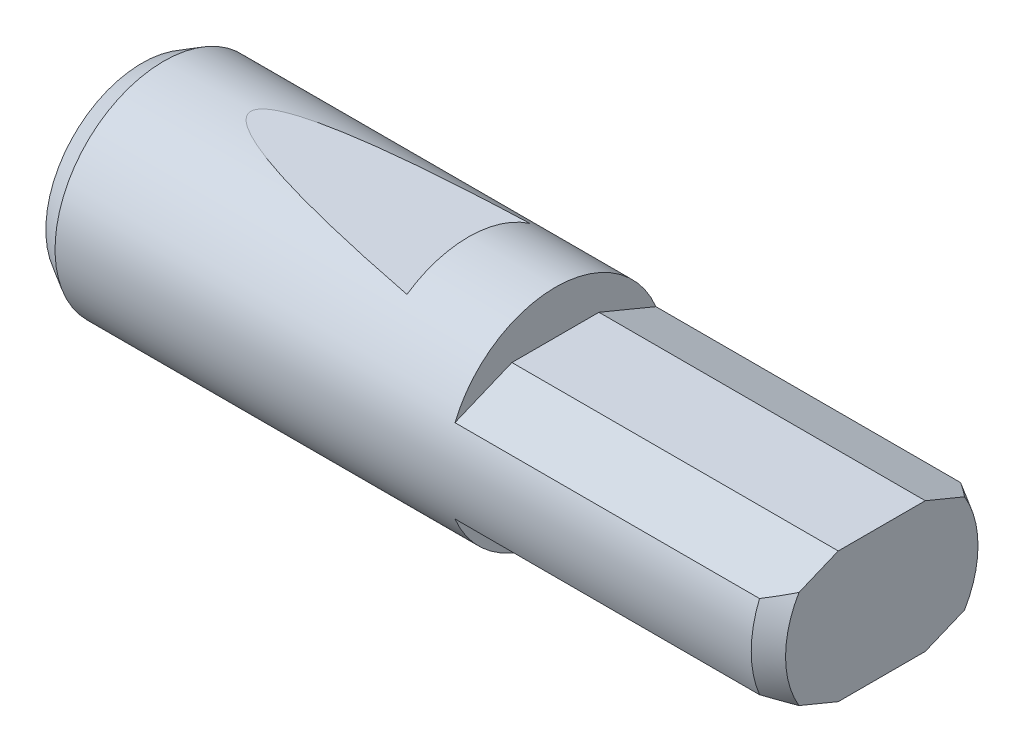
ISO-10303-21;
HEADER;
FILE_DESCRIPTION(('STEP AP214'),'2;1');
FILE_NAME('part.step','',(''),(''),'','','');
FILE_SCHEMA(('AUTOMOTIVE_DESIGN { 1 0 10303 214 1 1 1 1 }'));
ENDSEC;
DATA;
#1=APPLICATION_CONTEXT('core data for automotive mechanical design processes');
#2=APPLICATION_PROTOCOL_DEFINITION('international standard','automotive_design',2000,#1);
#3=PRODUCT_CONTEXT('',#1,'mechanical');
#4=PRODUCT('Part','Part','',(#3));
#5=PRODUCT_RELATED_PRODUCT_CATEGORY('part','',(#4));
#6=PRODUCT_DEFINITION_FORMATION('','',#4);
#7=PRODUCT_DEFINITION_CONTEXT('part definition',#1,'design');
#8=PRODUCT_DEFINITION('design','',#6,#7);
#9=PRODUCT_DEFINITION_SHAPE('','',#8);
#10=(LENGTH_UNIT() NAMED_UNIT(*) SI_UNIT(.MILLI.,.METRE.));
#11=(NAMED_UNIT(*) PLANE_ANGLE_UNIT() SI_UNIT($,.RADIAN.));
#12=(NAMED_UNIT(*) SI_UNIT($,.STERADIAN.) SOLID_ANGLE_UNIT());
#13=UNCERTAINTY_MEASURE_WITH_UNIT(LENGTH_MEASURE(1.E-05),#10,'distance_accuracy_value','');
#14=(GEOMETRIC_REPRESENTATION_CONTEXT(3) GLOBAL_UNCERTAINTY_ASSIGNED_CONTEXT((#13)) GLOBAL_UNIT_ASSIGNED_CONTEXT((#10,
#11,#12)) REPRESENTATION_CONTEXT('',''));
#15=CARTESIAN_POINT('',(0.,0.,0.));
#16=DIRECTION('',(0.,0.,1.));
#17=DIRECTION('',(1.,0.,0.));
#18=AXIS2_PLACEMENT_3D('',#15,#16,#17);
#19=CARTESIAN_POINT('',(-15.1011722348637,0.,0.));
#20=DIRECTION('',(-1.,0.,0.));
#21=DIRECTION('',(0.,0.,1.));
#22=AXIS2_PLACEMENT_3D('',#19,#20,#21);
#23=CYLINDRICAL_SURFACE('',#22,5.);
#24=DIRECTION('',(1.,0.,0.));
#25=VECTOR('',#24,1.);
#26=CARTESIAN_POINT('',(19.,-1.91534007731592,-4.61860069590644));
#27=LINE('',#26,#25);
#28=CARTESIAN_POINT('',(19.,-1.91534007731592,-4.61860069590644));
#29=VERTEX_POINT('',#28);
#30=CARTESIAN_POINT('',(33.,-1.91534007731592,-4.61860069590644));
#31=VERTEX_POINT('',#30);
#32=EDGE_CURVE('E589',#29,#31,#27,.T.);
#33=ORIENTED_EDGE('',*,*,#32,.F.);
#34=CARTESIAN_POINT('',(19.,0.,0.));
#35=DIRECTION('',(1.,0.,0.));
#36=DIRECTION('',(0.,0.,-1.));
#37=AXIS2_PLACEMENT_3D('',#34,#35,#36);
#38=CIRCLE('',#37,5.);
#39=CARTESIAN_POINT('',(19.,-1.91534007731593,4.61860069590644));
#40=VERTEX_POINT('',#39);
#41=EDGE_CURVE('E455',#40,#29,#38,.T.);
#42=ORIENTED_EDGE('',*,*,#41,.F.);
#43=DIRECTION('',(1.,0.,0.));
#44=VECTOR('',#43,1.);
#45=CARTESIAN_POINT('',(19.,-1.91534007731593,4.61860069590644));
#46=LINE('',#45,#44);
#47=CARTESIAN_POINT('',(33.,-1.91534007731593,4.61860069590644));
#48=VERTEX_POINT('',#47);
#49=EDGE_CURVE('E540',#40,#48,#46,.T.);
#50=ORIENTED_EDGE('',*,*,#49,.T.);
#51=CARTESIAN_POINT('',(33.,0.,0.));
#52=DIRECTION('',(-1.,0.,0.));
#53=DIRECTION('',(0.,0.,1.));
#54=AXIS2_PLACEMENT_3D('',#51,#52,#53);
#55=CIRCLE('',#54,5.);
#56=CARTESIAN_POINT('',(33.,1.91534007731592,4.61860069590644));
#57=VERTEX_POINT('',#56);
#58=EDGE_CURVE('E599',#48,#57,#55,.T.);
#59=ORIENTED_EDGE('',*,*,#58,.T.);
#60=DIRECTION('',(1.,0.,0.));
#61=VECTOR('',#60,1.);
#62=CARTESIAN_POINT('',(19.,1.91534007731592,4.61860069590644));
#63=LINE('',#62,#61);
#64=CARTESIAN_POINT('',(19.,1.91534007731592,4.61860069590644));
#65=VERTEX_POINT('',#64);
#66=EDGE_CURVE('E579',#65,#57,#63,.T.);
#67=ORIENTED_EDGE('',*,*,#66,.F.);
#68=CARTESIAN_POINT('',(19.,1.91534007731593,-4.61860069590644));
#69=VERTEX_POINT('',#68);
#70=EDGE_CURVE('E12',#69,#65,#38,.T.);
#71=ORIENTED_EDGE('',*,*,#70,.F.);
#72=DIRECTION('',(1.,0.,0.));
#73=VECTOR('',#72,1.);
#74=CARTESIAN_POINT('',(19.,1.91534007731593,-4.61860069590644));
#75=LINE('',#74,#73);
#76=CARTESIAN_POINT('',(33.,1.91534007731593,-4.61860069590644));
#77=VERTEX_POINT('',#76);
#78=EDGE_CURVE('E586',#69,#77,#75,.T.);
#79=ORIENTED_EDGE('',*,*,#78,.T.);
#80=EDGE_CURVE('E602',#77,#31,#55,.T.);
#81=ORIENTED_EDGE('',*,*,#80,.T.);
#82=EDGE_LOOP('',(#33,#42,#50,#59,#67,#71,#79,#81));
#83=FACE_BOUND('',#82,.T.);
#84=CARTESIAN_POINT('',(62.1502615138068,0.,0.));
#85=DIRECTION('',(-0.0871557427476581,-0.996194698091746,0.));
#86=DIRECTION('',(-0.996194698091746,0.0871557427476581,0.));
#87=AXIS2_PLACEMENT_3D('',#84,#85,#86);
#88=ELLIPSE('',#87,57.3685662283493,5.);
#89=CARTESIAN_POINT('',(15.,4.12511336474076,2.82549813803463));
#90=VERTEX_POINT('',#89);
#91=CARTESIAN_POINT('',(15.,4.12511336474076,-2.82549813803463));
#92=VERTEX_POINT('',#91);
#93=EDGE_CURVE('E608',#90,#92,#88,.T.);
#94=ORIENTED_EDGE('',*,*,#93,.T.);
#95=CARTESIAN_POINT('',(15.,0.,0.));
#96=DIRECTION('',(1.,0.,0.));
#97=DIRECTION('',(0.,0.,-1.));
#98=AXIS2_PLACEMENT_3D('',#95,#96,#97);
#99=CIRCLE('',#98,5.);
#100=EDGE_CURVE('E611',#92,#90,#99,.T.);
#101=ORIENTED_EDGE('',*,*,#100,.T.);
#102=EDGE_LOOP('',(#94,#101));
#103=FACE_BOUND('',#102,.T.);
#104=CARTESIAN_POINT('',(1.00000000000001,0.,0.));
#105=DIRECTION('',(1.,0.,0.));
#106=DIRECTION('',(0.,0.,-1.));
#107=AXIS2_PLACEMENT_3D('',#104,#105,#106);
#108=CIRCLE('',#107,5.);
#109=CARTESIAN_POINT('',(1.00000000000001,0.,-5.));
#110=VERTEX_POINT('',#109);
#111=EDGE_CURVE('E603',#110,#110,#108,.T.);
#112=ORIENTED_EDGE('',*,*,#111,.T.);
#113=EDGE_LOOP('',(#112));
#114=FACE_BOUND('',#113,.T.);
#115=ADVANCED_FACE('F451',(#83,#103,#114),#23,.T.);
#116=CARTESIAN_POINT('',(34.,5.,0.));
#117=DIRECTION('',(-1.,0.,0.));
#118=DIRECTION('',(0.,0.,1.));
#119=AXIS2_PLACEMENT_3D('',#116,#117,#118);
#120=PLANE('',#119);
#121=DIRECTION('',(0.,-0.382683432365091,0.923879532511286));
#122=VECTOR('',#121,1.);
#123=CARTESIAN_POINT('',(34.,1.91534007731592,4.61860069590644));
#124=LINE('',#123,#122);
#125=CARTESIAN_POINT('',(34.,3.,2.));
#126=VERTEX_POINT('',#125);
#127=CARTESIAN_POINT('',(34.,2.25171375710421,3.80652279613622));
#128=VERTEX_POINT('',#127);
#129=EDGE_CURVE('E562',#126,#128,#124,.T.);
#130=ORIENTED_EDGE('',*,*,#129,.T.);
#131=CARTESIAN_POINT('',(34.,0.,0.));
#132=DIRECTION('',(-1.,0.,0.));
#133=DIRECTION('',(0.,0.,1.));
#134=AXIS2_PLACEMENT_3D('',#131,#132,#133);
#135=CIRCLE('',#134,4.42264973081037);
#136=CARTESIAN_POINT('',(34.,-2.25171375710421,3.80652279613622));
#137=VERTEX_POINT('',#136);
#138=EDGE_CURVE('E554',#128,#137,#135,.F.);
#139=ORIENTED_EDGE('',*,*,#138,.T.);
#140=DIRECTION('',(0.,-0.38268343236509,-0.923879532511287));
#141=VECTOR('',#140,1.);
#142=CARTESIAN_POINT('',(34.,-1.91534007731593,4.61860069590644));
#143=LINE('',#142,#141);
#144=CARTESIAN_POINT('',(34.,-3.,2.));
#145=VERTEX_POINT('',#144);
#146=EDGE_CURVE('E474',#137,#145,#143,.T.);
#147=ORIENTED_EDGE('',*,*,#146,.T.);
#148=DIRECTION('',(0.,0.,-1.));
#149=VECTOR('',#148,1.);
#150=CARTESIAN_POINT('',(34.,-3.,2.));
#151=LINE('',#150,#149);
#152=CARTESIAN_POINT('',(34.,-3.,-2.));
#153=VERTEX_POINT('',#152);
#154=EDGE_CURVE('E543',#145,#153,#151,.T.);
#155=ORIENTED_EDGE('',*,*,#154,.T.);
#156=DIRECTION('',(0.,0.382683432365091,-0.923879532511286));
#157=VECTOR('',#156,1.);
#158=CARTESIAN_POINT('',(34.,-1.91534007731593,-4.61860069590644));
#159=LINE('',#158,#157);
#160=CARTESIAN_POINT('',(34.,-2.25171375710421,-3.80652279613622));
#161=VERTEX_POINT('',#160);
#162=EDGE_CURVE('E548',#153,#161,#159,.T.);
#163=ORIENTED_EDGE('',*,*,#162,.T.);
#164=CARTESIAN_POINT('',(34.,2.25171375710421,-3.80652279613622));
#165=VERTEX_POINT('',#164);
#166=EDGE_CURVE('E607',#161,#165,#135,.F.);
#167=ORIENTED_EDGE('',*,*,#166,.T.);
#168=DIRECTION('',(0.,0.382683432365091,0.923879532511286));
#169=VECTOR('',#168,1.);
#170=CARTESIAN_POINT('',(34.,1.91534007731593,-4.61860069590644));
#171=LINE('',#170,#169);
#172=CARTESIAN_POINT('',(34.,3.,-2.));
#173=VERTEX_POINT('',#172);
#174=EDGE_CURVE('E466',#165,#173,#171,.T.);
#175=ORIENTED_EDGE('',*,*,#174,.T.);
#176=DIRECTION('',(0.,0.,1.));
#177=VECTOR('',#176,1.);
#178=CARTESIAN_POINT('',(34.,3.,2.));
#179=LINE('',#178,#177);
#180=EDGE_CURVE('E559',#173,#126,#179,.T.);
#181=ORIENTED_EDGE('',*,*,#180,.T.);
#182=EDGE_LOOP('',(#130,#139,#147,#155,#163,#167,#175,#181));
#183=FACE_BOUND('',#182,.T.);
#184=ADVANCED_FACE('F552',(#183),#120,.F.);
#185=CARTESIAN_POINT('',(33.,0.,0.));
#186=DIRECTION('',(-1.,0.,0.));
#187=DIRECTION('',(0.,0.,1.));
#188=AXIS2_PLACEMENT_3D('',#185,#186,#187);
#189=CONICAL_SURFACE('',#188,5.,0.523598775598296);
#190=ORIENTED_EDGE('',*,*,#138,.F.);
#191=CARTESIAN_POINT('',(35.161249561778,3.74705592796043,0.196447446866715));
#192=CARTESIAN_POINT('',(35.1967152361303,3.72356616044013,0.253156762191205));
#193=CARTESIAN_POINT('',(35.2304698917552,3.69969981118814,0.310775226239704));
#194=CARTESIAN_POINT('',(35.293895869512,3.65111947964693,0.428058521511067));
#195=CARTESIAN_POINT('',(35.323557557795,3.6264036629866,0.48772778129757));
#196=CARTESIAN_POINT('',(35.4055078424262,3.55069271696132,0.670510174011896));
#197=CARTESIAN_POINT('',(35.450300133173,3.49842620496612,0.796692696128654));
#198=CARTESIAN_POINT('',(35.5076912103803,3.40073436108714,1.03254167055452));
#199=CARTESIAN_POINT('',(35.5245002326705,3.35567733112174,1.14131896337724));
#200=CARTESIAN_POINT('',(35.5373572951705,3.2653197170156,1.35946154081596));
#201=CARTESIAN_POINT('',(35.5335030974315,3.2200212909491,1.46882161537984));
#202=CARTESIAN_POINT('',(35.5058602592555,3.13044470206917,1.6850786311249));
#203=CARTESIAN_POINT('',(35.4821067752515,3.08616488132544,1.79197957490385));
#204=CARTESIAN_POINT('',(35.4177384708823,2.99938503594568,2.0014846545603));
#205=CARTESIAN_POINT('',(35.3770837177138,2.9568894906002,2.1040779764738));
#206=CARTESIAN_POINT('',(35.2876469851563,2.87842262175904,2.29351375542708));
#207=CARTESIAN_POINT('',(35.2401444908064,2.84223165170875,2.38088648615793));
#208=CARTESIAN_POINT('',(35.1370499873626,2.77155999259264,2.55150296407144));
#209=CARTESIAN_POINT('',(35.0814510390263,2.7370808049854,2.63474308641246));
#210=CARTESIAN_POINT('',(34.9635303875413,2.66938092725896,2.79818504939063));
#211=CARTESIAN_POINT('',(34.9011483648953,2.63617580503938,2.87834930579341));
#212=CARTESIAN_POINT('',(34.7716061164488,2.57119688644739,3.03522229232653));
#213=CARTESIAN_POINT('',(34.7044482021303,2.53942240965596,3.1119326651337));
#214=CARTESIAN_POINT('',(34.5721696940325,2.47969865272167,3.25611856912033));
#215=CARTESIAN_POINT('',(34.5073482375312,2.4516516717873,3.3238299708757));
#216=CARTESIAN_POINT('',(34.3751684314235,2.39644494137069,3.45711080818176));
#217=CARTESIAN_POINT('',(34.3078097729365,2.36928530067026,3.52267998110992));
#218=CARTESIAN_POINT('',(34.1025781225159,2.28892733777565,3.71668126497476));
#219=CARTESIAN_POINT('',(33.9616226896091,2.23688223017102,3.84232926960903));
#220=CARTESIAN_POINT('',(33.6736021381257,2.1349587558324,4.0883943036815));
#221=CARTESIAN_POINT('',(33.5265170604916,2.08508875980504,4.20879112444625));
#222=CARTESIAN_POINT('',(33.228246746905,1.98717050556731,4.44518670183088));
#223=CARTESIAN_POINT('',(33.0770609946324,1.93912247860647,4.56118490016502));
#224=CARTESIAN_POINT('',(32.7836270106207,1.84818151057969,4.7807358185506));
#225=CARTESIAN_POINT('',(32.6416077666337,1.80517980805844,4.88455111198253));
#226=CARTESIAN_POINT('',(32.3555287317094,1.72017281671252,5.08977614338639));
#227=CARTESIAN_POINT('',(32.2114687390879,1.67816762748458,5.19118564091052));
#228=CARTESIAN_POINT('',(31.922962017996,1.5953357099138,5.39115957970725));
#229=CARTESIAN_POINT('',(31.7785289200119,1.55450201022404,5.48974085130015));
#230=CARTESIAN_POINT('',(31.4883842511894,1.47352875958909,5.68522757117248));
#231=CARTESIAN_POINT('',(31.3426729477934,1.43338906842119,5.78213335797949));
#232=CARTESIAN_POINT('',(31.1964474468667,1.39352917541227,5.87836365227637));
#233=B_SPLINE_CURVE_WITH_KNOTS('',3,(#191,#192,#193,#194,#195,#196,#197,#198,#199,#200,#201,
#202,#203,#204,#205,#206,#207,#208,#209,#210,#211,#212,#213,#214,#215,#216,#217,#218,#219,#220,
#221,#222,#223,#224,#225,#226,#227,#228,#229,#230,#231,#232),.UNSPECIFIED.,.F.,.F.,(4,2,2,2,2,2,
2,2,2,2,2,2,2,2,2,2,2,2,2,2,4),(0.,0.212612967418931,0.425718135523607,0.854581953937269,
1.2097300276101,1.56319930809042,1.91604542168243,2.26972998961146,2.58674808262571,
2.90403949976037,3.22442777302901,3.54466202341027,3.83812144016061,4.13161669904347,
4.71894159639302,5.30835679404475,5.8978465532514,6.44110367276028,6.98441486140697,
7.52312039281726,8.06171577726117),.UNSPECIFIED.);
#234=EDGE_CURVE('E696',#128,#57,#233,.T.);
#235=ORIENTED_EDGE('',*,*,#234,.T.);
#236=ORIENTED_EDGE('',*,*,#58,.F.);
#237=CARTESIAN_POINT('',(31.1964474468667,-1.39352917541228,5.87836365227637));
#238=CARTESIAN_POINT('',(31.3497994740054,-1.43533328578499,5.77743960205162));
#239=CARTESIAN_POINT('',(31.5025894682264,-1.47744394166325,5.6757754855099));
#240=CARTESIAN_POINT('',(31.8067480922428,-1.56243475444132,5.47058951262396));
#241=CARTESIAN_POINT('',(31.958116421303,-1.60531506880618,5.36706727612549));
#242=CARTESIAN_POINT('',(32.2592817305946,-1.6920452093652,5.1576821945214));
#243=CARTESIAN_POINT('',(32.4090762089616,-1.73589631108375,5.05181627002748));
#244=CARTESIAN_POINT('',(32.7063875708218,-1.82470977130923,4.83740160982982));
#245=CARTESIAN_POINT('',(32.8539046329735,-1.8696720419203,4.72885308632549));
#246=CARTESIAN_POINT('',(33.1221362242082,-1.95351871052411,4.52642932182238));
#247=CARTESIAN_POINT('',(33.243292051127,-1.9921959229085,4.4330542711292));
#248=CARTESIAN_POINT('',(33.482982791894,-2.07072040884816,4.24347939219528));
#249=CARTESIAN_POINT('',(33.6015178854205,-2.11056760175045,4.14727975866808));
#250=CARTESIAN_POINT('',(33.8353687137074,-2.19175856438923,3.95126743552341));
#251=CARTESIAN_POINT('',(33.9506794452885,-2.23310445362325,3.85144962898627));
#252=CARTESIAN_POINT('',(34.1767546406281,-2.31757716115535,3.6475144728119));
#253=CARTESIAN_POINT('',(34.2875200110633,-2.36070362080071,3.54339798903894));
#254=CARTESIAN_POINT('',(34.4776385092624,-2.43885166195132,3.35473192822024));
#255=CARTESIAN_POINT('',(34.558282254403,-2.47341144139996,3.2712972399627));
#256=CARTESIAN_POINT('',(34.7147970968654,-2.54411222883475,3.10061044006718));
#257=CARTESIAN_POINT('',(34.7906665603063,-2.58025377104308,3.01335703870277));
#258=CARTESIAN_POINT('',(34.9358494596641,-2.65431164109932,2.83456552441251));
#259=CARTESIAN_POINT('',(35.0051770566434,-2.69222385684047,2.74303733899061));
#260=CARTESIAN_POINT('',(35.1351467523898,-2.77014930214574,2.55490867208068));
#261=CARTESIAN_POINT('',(35.1957970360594,-2.81016050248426,2.45831308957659));
#262=CARTESIAN_POINT('',(35.3099319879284,-2.89591526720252,2.25128277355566));
#263=CARTESIAN_POINT('',(35.3624124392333,-2.94185941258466,2.14036379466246));
#264=CARTESIAN_POINT('',(35.4484491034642,-3.03620011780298,1.91260518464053));
#265=CARTESIAN_POINT('',(35.4820764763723,-3.0845866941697,1.7957896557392));
#266=CARTESIAN_POINT('',(35.5150886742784,-3.1585301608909,1.617274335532));
#267=CARTESIAN_POINT('',(35.5231837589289,-3.18353846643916,1.55689894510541));
#268=CARTESIAN_POINT('',(35.5330938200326,-3.23374316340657,1.43569408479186));
#269=CARTESIAN_POINT('',(35.5349088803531,-3.25893955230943,1.37486462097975));
#270=CARTESIAN_POINT('',(35.5321527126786,-3.30940969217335,1.2530189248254));
#271=CARTESIAN_POINT('',(35.5275484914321,-3.33468317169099,1.19200334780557));
#272=CARTESIAN_POINT('',(35.5121146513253,-3.38494501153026,1.07066053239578));
#273=CARTESIAN_POINT('',(35.5012853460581,-3.40993338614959,1.01033325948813));
#274=CARTESIAN_POINT('',(35.4722638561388,-3.46232352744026,0.883852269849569));
#275=CARTESIAN_POINT('',(35.4533608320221,-3.48966727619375,0.817838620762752));
#276=CARTESIAN_POINT('',(35.4092231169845,-3.54359945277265,0.687634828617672));
#277=CARTESIAN_POINT('',(35.3839855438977,-3.57018753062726,0.623445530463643));
#278=CARTESIAN_POINT('',(35.3283008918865,-3.6223430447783,0.497530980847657));
#279=CARTESIAN_POINT('',(35.2978880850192,-3.64791591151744,0.43579261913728));
#280=CARTESIAN_POINT('',(35.2326633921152,-3.69815133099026,0.31451358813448));
#281=CARTESIAN_POINT('',(35.1978625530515,-3.72281597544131,0.25496786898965));
#282=CARTESIAN_POINT('',(35.161249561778,-3.74705592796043,0.196447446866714));
#283=B_SPLINE_CURVE_WITH_KNOTS('',3,(#237,#238,#239,#240,#241,#242,#243,#244,#245,#246,#247,
#248,#249,#250,#251,#252,#253,#254,#255,#256,#257,#258,#259,#260,#261,#262,#263,#264,#265,#266,
#267,#268,#269,#270,#271,#272,#273,#274,#275,#276,#277,#278,#279,#280,#281,#282),.UNSPECIFIED.,
.F.,.F.,(4,2,2,2,2,2,2,2,2,2,2,2,2,2,2,2,2,2,2,2,2,2,4),(0.,0.564853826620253,1.12982456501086,
1.69558776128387,2.26130634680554,2.73459720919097,3.20785552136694,3.68181145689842,
4.15567238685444,4.51877115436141,4.88199351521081,5.24441065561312,5.60648365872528,
5.99843301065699,6.38889283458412,6.58617852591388,6.78346158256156,6.98176236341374,
7.18005315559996,7.4014465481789,7.62294085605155,7.8430217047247,8.06255916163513),.UNSPECIFIED.);
#284=EDGE_CURVE('E614',#48,#137,#283,.T.);
#285=ORIENTED_EDGE('',*,*,#284,.T.);
#286=EDGE_LOOP('',(#190,#235,#236,#285));
#287=FACE_BOUND('',#286,.T.);
#288=ADVANCED_FACE('F627',(#287),#189,.T.);
#289=ORIENTED_EDGE('',*,*,#80,.F.);
#290=CARTESIAN_POINT('',(31.1964474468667,1.39352917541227,-5.87836365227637));
#291=CARTESIAN_POINT('',(31.3497994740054,1.43533328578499,-5.77743960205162));
#292=CARTESIAN_POINT('',(31.5025894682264,1.47744394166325,-5.6757754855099));
#293=CARTESIAN_POINT('',(31.8067480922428,1.56243475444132,-5.47058951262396));
#294=CARTESIAN_POINT('',(31.958116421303,1.60531506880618,-5.3670672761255));
#295=CARTESIAN_POINT('',(32.2592817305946,1.69204520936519,-5.1576821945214));
#296=CARTESIAN_POINT('',(32.4090762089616,1.73589631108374,-5.05181627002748));
#297=CARTESIAN_POINT('',(32.7063875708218,1.82470977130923,-4.83740160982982));
#298=CARTESIAN_POINT('',(32.8539046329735,1.8696720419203,-4.72885308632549));
#299=CARTESIAN_POINT('',(33.1221362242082,1.9535187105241,-4.52642932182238));
#300=CARTESIAN_POINT('',(33.243292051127,1.9921959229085,-4.4330542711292));
#301=CARTESIAN_POINT('',(33.482982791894,2.07072040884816,-4.24347939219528));
#302=CARTESIAN_POINT('',(33.6015178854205,2.11056760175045,-4.14727975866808));
#303=CARTESIAN_POINT('',(33.8353687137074,2.19175856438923,-3.95126743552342));
#304=CARTESIAN_POINT('',(33.9506794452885,2.23310445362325,-3.85144962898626));
#305=CARTESIAN_POINT('',(34.1767546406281,2.31757716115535,-3.6475144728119));
#306=CARTESIAN_POINT('',(34.2875200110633,2.36070362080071,-3.54339798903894));
#307=CARTESIAN_POINT('',(34.4776385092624,2.43885166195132,-3.35473192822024));
#308=CARTESIAN_POINT('',(34.558282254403,2.47341144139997,-3.2712972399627));
#309=CARTESIAN_POINT('',(34.7147970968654,2.54411222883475,-3.10061044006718));
#310=CARTESIAN_POINT('',(34.7906665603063,2.58025377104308,-3.01335703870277));
#311=CARTESIAN_POINT('',(34.9358494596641,2.65431164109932,-2.83456552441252));
#312=CARTESIAN_POINT('',(35.0051770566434,2.69222385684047,-2.74303733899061));
#313=CARTESIAN_POINT('',(35.1351467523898,2.77014930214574,-2.55490867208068));
#314=CARTESIAN_POINT('',(35.1957970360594,2.81016050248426,-2.4583130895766));
#315=CARTESIAN_POINT('',(35.3099319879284,2.89591526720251,-2.25128277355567));
#316=CARTESIAN_POINT('',(35.3624124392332,2.94185941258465,-2.14036379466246));
#317=CARTESIAN_POINT('',(35.4484491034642,3.03620011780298,-1.91260518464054));
#318=CARTESIAN_POINT('',(35.4820764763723,3.0845866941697,-1.79578965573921));
#319=CARTESIAN_POINT('',(35.5150886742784,3.1585301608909,-1.61727433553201));
#320=CARTESIAN_POINT('',(35.5231837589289,3.18353846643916,-1.55689894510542));
#321=CARTESIAN_POINT('',(35.5330938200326,3.23374316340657,-1.43569408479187));
#322=CARTESIAN_POINT('',(35.5349088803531,3.25893955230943,-1.37486462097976));
#323=CARTESIAN_POINT('',(35.5321527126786,3.30940969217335,-1.25301892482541));
#324=CARTESIAN_POINT('',(35.5275484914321,3.33468317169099,-1.19200334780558));
#325=CARTESIAN_POINT('',(35.5121146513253,3.38494501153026,-1.07066053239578));
#326=CARTESIAN_POINT('',(35.5012853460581,3.40993338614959,-1.01033325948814));
#327=CARTESIAN_POINT('',(35.4722638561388,3.46232352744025,-0.883852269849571));
#328=CARTESIAN_POINT('',(35.4533608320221,3.48966727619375,-0.817838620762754));
#329=CARTESIAN_POINT('',(35.4092231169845,3.54359945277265,-0.687634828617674));
#330=CARTESIAN_POINT('',(35.3839855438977,3.57018753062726,-0.623445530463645));
#331=CARTESIAN_POINT('',(35.3283008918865,3.6223430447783,-0.497530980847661));
#332=CARTESIAN_POINT('',(35.2978880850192,3.64791591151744,-0.435792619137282));
#333=CARTESIAN_POINT('',(35.2326633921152,3.69815133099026,-0.314513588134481));
#334=CARTESIAN_POINT('',(35.1978625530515,3.72281597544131,-0.254967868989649));
#335=CARTESIAN_POINT('',(35.161249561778,3.74705592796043,-0.196447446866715));
#336=B_SPLINE_CURVE_WITH_KNOTS('',3,(#290,#291,#292,#293,#294,#295,#296,#297,#298,#299,#300,
#301,#302,#303,#304,#305,#306,#307,#308,#309,#310,#311,#312,#313,#314,#315,#316,#317,#318,#319,
#320,#321,#322,#323,#324,#325,#326,#327,#328,#329,#330,#331,#332,#333,#334,#335),.UNSPECIFIED.,
.F.,.F.,(4,2,2,2,2,2,2,2,2,2,2,2,2,2,2,2,2,2,2,2,2,2,4),(0.,0.564853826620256,1.12982456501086,
1.69558776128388,2.26130634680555,2.73459720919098,3.20785552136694,3.68181145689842,
4.15567238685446,4.51877115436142,4.8819935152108,5.24441065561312,5.60648365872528,
5.99843301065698,6.38889283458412,6.58617852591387,6.78346158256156,6.98176236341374,
7.18005315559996,7.40144654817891,7.62294085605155,7.8430217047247,8.06255916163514),.UNSPECIFIED.);
#337=EDGE_CURVE('E682',#77,#165,#336,.T.);
#338=ORIENTED_EDGE('',*,*,#337,.T.);
#339=ORIENTED_EDGE('',*,*,#166,.F.);
#340=CARTESIAN_POINT('',(35.161249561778,-3.74705592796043,-0.196447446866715));
#341=CARTESIAN_POINT('',(35.1967152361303,-3.72356616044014,-0.253156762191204));
#342=CARTESIAN_POINT('',(35.2304698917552,-3.69969981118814,-0.310775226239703));
#343=CARTESIAN_POINT('',(35.293895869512,-3.65111947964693,-0.428058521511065));
#344=CARTESIAN_POINT('',(35.323557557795,-3.6264036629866,-0.48772778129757));
#345=CARTESIAN_POINT('',(35.4055078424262,-3.55069271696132,-0.670510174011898));
#346=CARTESIAN_POINT('',(35.450300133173,-3.49842620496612,-0.796692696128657));
#347=CARTESIAN_POINT('',(35.5076912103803,-3.40073436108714,-1.03254167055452));
#348=CARTESIAN_POINT('',(35.5245002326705,-3.35567733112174,-1.14131896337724));
#349=CARTESIAN_POINT('',(35.5373572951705,-3.26531971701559,-1.35946154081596));
#350=CARTESIAN_POINT('',(35.5335030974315,-3.2200212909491,-1.46882161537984));
#351=CARTESIAN_POINT('',(35.5058602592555,-3.13044470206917,-1.6850786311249));
#352=CARTESIAN_POINT('',(35.4821067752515,-3.08616488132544,-1.79197957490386));
#353=CARTESIAN_POINT('',(35.4177384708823,-2.99938503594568,-2.00148465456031));
#354=CARTESIAN_POINT('',(35.3770837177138,-2.9568894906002,-2.10407797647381));
#355=CARTESIAN_POINT('',(35.2876469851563,-2.87842262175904,-2.29351375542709));
#356=CARTESIAN_POINT('',(35.2401444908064,-2.84223165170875,-2.38088648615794));
#357=CARTESIAN_POINT('',(35.1370499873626,-2.77155999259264,-2.55150296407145));
#358=CARTESIAN_POINT('',(35.0814510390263,-2.7370808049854,-2.63474308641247));
#359=CARTESIAN_POINT('',(34.9635303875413,-2.66938092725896,-2.79818504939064));
#360=CARTESIAN_POINT('',(34.9011483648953,-2.63617580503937,-2.87834930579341));
#361=CARTESIAN_POINT('',(34.7716061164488,-2.57119688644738,-3.03522229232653));
#362=CARTESIAN_POINT('',(34.7044482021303,-2.53942240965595,-3.11193266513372));
#363=CARTESIAN_POINT('',(34.5721696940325,-2.47969865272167,-3.25611856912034));
#364=CARTESIAN_POINT('',(34.5073482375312,-2.4516516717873,-3.32382997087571));
#365=CARTESIAN_POINT('',(34.3751684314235,-2.39644494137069,-3.45711080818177));
#366=CARTESIAN_POINT('',(34.3078097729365,-2.36928530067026,-3.52267998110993));
#367=CARTESIAN_POINT('',(34.1025781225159,-2.28892733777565,-3.71668126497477));
#368=CARTESIAN_POINT('',(33.9616226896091,-2.23688223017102,-3.84232926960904));
#369=CARTESIAN_POINT('',(33.6736021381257,-2.1349587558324,-4.0883943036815));
#370=CARTESIAN_POINT('',(33.5265170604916,-2.08508875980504,-4.20879112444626));
#371=CARTESIAN_POINT('',(33.228246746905,-1.98717050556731,-4.44518670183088));
#372=CARTESIAN_POINT('',(33.0770609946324,-1.93912247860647,-4.56118490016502));
#373=CARTESIAN_POINT('',(32.7836270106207,-1.84818151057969,-4.7807358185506));
#374=CARTESIAN_POINT('',(32.6416077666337,-1.80517980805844,-4.88455111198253));
#375=CARTESIAN_POINT('',(32.3555287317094,-1.72017281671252,-5.08977614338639));
#376=CARTESIAN_POINT('',(32.2114687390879,-1.67816762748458,-5.19118564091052));
#377=CARTESIAN_POINT('',(31.922962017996,-1.59533570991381,-5.39115957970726));
#378=CARTESIAN_POINT('',(31.7785289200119,-1.55450201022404,-5.48974085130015));
#379=CARTESIAN_POINT('',(31.4883842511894,-1.47352875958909,-5.68522757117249));
#380=CARTESIAN_POINT('',(31.3426729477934,-1.43338906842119,-5.7821333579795));
#381=CARTESIAN_POINT('',(31.1964474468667,-1.39352917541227,-5.87836365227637));
#382=B_SPLINE_CURVE_WITH_KNOTS('',3,(#340,#341,#342,#343,#344,#345,#346,#347,#348,#349,#350,
#351,#352,#353,#354,#355,#356,#357,#358,#359,#360,#361,#362,#363,#364,#365,#366,#367,#368,#369,
#370,#371,#372,#373,#374,#375,#376,#377,#378,#379,#380,#381),.UNSPECIFIED.,.F.,.F.,(4,2,2,2,2,2,
2,2,2,2,2,2,2,2,2,2,2,2,2,2,4),(0.,0.212612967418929,0.425718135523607,0.854581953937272,
1.20973002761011,1.56319930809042,1.91604542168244,2.26972998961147,2.58674808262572,
2.90403949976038,3.22442777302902,3.54466202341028,3.83812144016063,4.13161669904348,
4.71894159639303,5.30835679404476,5.89784655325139,6.44110367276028,6.98441486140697,
7.52312039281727,8.06171577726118),.UNSPECIFIED.);
#383=EDGE_CURVE('E621',#161,#31,#382,.T.);
#384=ORIENTED_EDGE('',*,*,#383,.T.);
#385=EDGE_LOOP('',(#289,#338,#339,#384));
#386=FACE_BOUND('',#385,.T.);
#387=ADVANCED_FACE('F670',(#386),#189,.T.);
#388=CARTESIAN_POINT('',(0.,0.,0.));
#389=DIRECTION('',(1.,0.,0.));
#390=DIRECTION('',(0.,0.,-1.));
#391=AXIS2_PLACEMENT_3D('',#388,#389,#390);
#392=PLANE('',#391);
#393=CARTESIAN_POINT('',(0.,0.,0.));
#394=DIRECTION('',(1.,0.,0.));
#395=DIRECTION('',(0.,0.,-1.));
#396=AXIS2_PLACEMENT_3D('',#393,#394,#395);
#397=CIRCLE('',#396,4.42264973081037);
#398=CARTESIAN_POINT('',(0.,0.,-4.42264973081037));
#399=VERTEX_POINT('',#398);
#400=EDGE_CURVE('E596',#399,#399,#397,.F.);
#401=ORIENTED_EDGE('',*,*,#400,.T.);
#402=EDGE_LOOP('',(#401));
#403=FACE_BOUND('',#402,.T.);
#404=ADVANCED_FACE('F453',(#403),#392,.F.);
#405=CARTESIAN_POINT('',(0.,0.,0.));
#406=DIRECTION('',(1.,0.,0.));
#407=DIRECTION('',(0.,0.,-1.));
#408=AXIS2_PLACEMENT_3D('',#405,#406,#407);
#409=CONICAL_SURFACE('',#408,4.42264973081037,0.523598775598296);
#410=ORIENTED_EDGE('',*,*,#111,.F.);
#411=EDGE_LOOP('',(#410));
#412=FACE_BOUND('',#411,.T.);
#413=ORIENTED_EDGE('',*,*,#400,.F.);
#414=EDGE_LOOP('',(#413));
#415=FACE_BOUND('',#414,.T.);
#416=ADVANCED_FACE('F647',(#412,#415),#409,.T.);
#417=CARTESIAN_POINT('',(15.,5.,-5.));
#418=DIRECTION('',(1.,0.,0.));
#419=DIRECTION('',(0.,0.,-1.));
#420=AXIS2_PLACEMENT_3D('',#417,#418,#419);
#421=PLANE('',#420);
#422=DIRECTION('',(0.,0.,1.));
#423=VECTOR('',#422,1.);
#424=CARTESIAN_POINT('',(15.,4.12511336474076,-5.));
#425=LINE('',#424,#423);
#426=EDGE_CURVE('E581',#92,#90,#425,.T.);
#427=ORIENTED_EDGE('',*,*,#426,.T.);
#428=ORIENTED_EDGE('',*,*,#100,.F.);
#429=EDGE_LOOP('',(#427,#428));
#430=FACE_BOUND('',#429,.T.);
#431=ADVANCED_FACE('F644',(#430),#421,.F.);
#432=CARTESIAN_POINT('',(15.,4.12511336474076,-5.));
#433=DIRECTION('',(-0.0871557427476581,-0.996194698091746,0.));
#434=DIRECTION('',(0.996194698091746,-0.0871557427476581,0.));
#435=AXIS2_PLACEMENT_3D('',#432,#433,#434);
#436=PLANE('',#435);
#437=ORIENTED_EDGE('',*,*,#93,.F.);
#438=ORIENTED_EDGE('',*,*,#426,.F.);
#439=EDGE_LOOP('',(#437,#438));
#440=FACE_BOUND('',#439,.T.);
#441=ADVANCED_FACE('F636',(#440),#436,.F.);
#442=CARTESIAN_POINT('',(19.,-1.91534007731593,4.61860069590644));
#443=DIRECTION('',(0.,-0.923879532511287,0.38268343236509));
#444=DIRECTION('',(0.,-0.38268343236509,-0.923879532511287));
#445=AXIS2_PLACEMENT_3D('',#442,#443,#444);
#446=PLANE('',#445);
#447=ORIENTED_EDGE('',*,*,#49,.F.);
#448=DIRECTION('',(0.,-0.38268343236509,-0.923879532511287));
#449=VECTOR('',#448,1.);
#450=CARTESIAN_POINT('',(19.,-1.91534007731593,4.61860069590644));
#451=LINE('',#450,#449);
#452=CARTESIAN_POINT('',(19.,-3.,2.));
#453=VERTEX_POINT('',#452);
#454=EDGE_CURVE('E536',#40,#453,#451,.T.);
#455=ORIENTED_EDGE('',*,*,#454,.T.);
#456=DIRECTION('',(1.,0.,0.));
#457=VECTOR('',#456,1.);
#458=CARTESIAN_POINT('',(19.,-3.,2.));
#459=LINE('',#458,#457);
#460=EDGE_CURVE('E532',#453,#145,#459,.T.);
#461=ORIENTED_EDGE('',*,*,#460,.T.);
#462=ORIENTED_EDGE('',*,*,#146,.F.);
#463=ORIENTED_EDGE('',*,*,#284,.F.);
#464=EDGE_LOOP('',(#447,#455,#461,#462,#463));
#465=FACE_BOUND('',#464,.T.);
#466=ADVANCED_FACE('F534',(#465),#446,.T.);
#467=CARTESIAN_POINT('',(19.,-1.91534007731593,-4.61860069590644));
#468=DIRECTION('',(0.,-0.923879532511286,-0.382683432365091));
#469=DIRECTION('',(0.,0.382683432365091,-0.923879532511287));
#470=AXIS2_PLACEMENT_3D('',#467,#468,#469);
#471=PLANE('',#470);
#472=ORIENTED_EDGE('',*,*,#162,.F.);
#473=DIRECTION('',(1.,0.,0.));
#474=VECTOR('',#473,1.);
#475=CARTESIAN_POINT('',(19.,-3.,-2.));
#476=LINE('',#475,#474);
#477=CARTESIAN_POINT('',(19.,-3.,-2.));
#478=VERTEX_POINT('',#477);
#479=EDGE_CURVE('E539',#478,#153,#476,.T.);
#480=ORIENTED_EDGE('',*,*,#479,.F.);
#481=DIRECTION('',(0.,0.382683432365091,-0.923879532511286));
#482=VECTOR('',#481,1.);
#483=CARTESIAN_POINT('',(19.,-1.91534007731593,-4.61860069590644));
#484=LINE('',#483,#482);
#485=EDGE_CURVE('E567',#478,#29,#484,.T.);
#486=ORIENTED_EDGE('',*,*,#485,.T.);
#487=ORIENTED_EDGE('',*,*,#32,.T.);
#488=ORIENTED_EDGE('',*,*,#383,.F.);
#489=EDGE_LOOP('',(#472,#480,#486,#487,#488));
#490=FACE_BOUND('',#489,.T.);
#491=ADVANCED_FACE('F635',(#490),#471,.T.);
#492=CARTESIAN_POINT('',(19.,-3.,2.));
#493=DIRECTION('',(0.,-1.,0.));
#494=DIRECTION('',(0.,0.,-1.));
#495=AXIS2_PLACEMENT_3D('',#492,#493,#494);
#496=PLANE('',#495);
#497=ORIENTED_EDGE('',*,*,#154,.F.);
#498=ORIENTED_EDGE('',*,*,#460,.F.);
#499=DIRECTION('',(0.,0.,-1.));
#500=VECTOR('',#499,1.);
#501=CARTESIAN_POINT('',(19.,-3.,2.));
#502=LINE('',#501,#500);
#503=EDGE_CURVE('E565',#453,#478,#502,.T.);
#504=ORIENTED_EDGE('',*,*,#503,.T.);
#505=ORIENTED_EDGE('',*,*,#479,.T.);
#506=EDGE_LOOP('',(#497,#498,#504,#505));
#507=FACE_BOUND('',#506,.T.);
#508=ADVANCED_FACE('F544',(#507),#496,.T.);
#509=CARTESIAN_POINT('',(19.,1.18828558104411E-13,0.0271047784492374));
#510=DIRECTION('',(1.,0.,0.));
#511=DIRECTION('',(0.,0.,-1.));
#512=AXIS2_PLACEMENT_3D('',#509,#510,#511);
#513=PLANE('',#512);
#514=ORIENTED_EDGE('',*,*,#41,.T.);
#515=ORIENTED_EDGE('',*,*,#485,.F.);
#516=ORIENTED_EDGE('',*,*,#503,.F.);
#517=ORIENTED_EDGE('',*,*,#454,.F.);
#518=EDGE_LOOP('',(#514,#515,#516,#517));
#519=FACE_BOUND('',#518,.T.);
#520=ADVANCED_FACE('F641',(#519),#513,.T.);
#521=ORIENTED_EDGE('',*,*,#70,.T.);
#522=DIRECTION('',(0.,-0.382683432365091,0.923879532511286));
#523=VECTOR('',#522,1.);
#524=CARTESIAN_POINT('',(19.,1.91534007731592,4.61860069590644));
#525=LINE('',#524,#523);
#526=CARTESIAN_POINT('',(19.,3.,2.));
#527=VERTEX_POINT('',#526);
#528=EDGE_CURVE('E576',#527,#65,#525,.T.);
#529=ORIENTED_EDGE('',*,*,#528,.F.);
#530=DIRECTION('',(0.,0.,1.));
#531=VECTOR('',#530,1.);
#532=CARTESIAN_POINT('',(19.,3.,2.));
#533=LINE('',#532,#531);
#534=CARTESIAN_POINT('',(19.,3.,-2.));
#535=VERTEX_POINT('',#534);
#536=EDGE_CURVE('E573',#535,#527,#533,.T.);
#537=ORIENTED_EDGE('',*,*,#536,.F.);
#538=DIRECTION('',(0.,0.382683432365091,0.923879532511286));
#539=VECTOR('',#538,1.);
#540=CARTESIAN_POINT('',(19.,1.91534007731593,-4.61860069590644));
#541=LINE('',#540,#539);
#542=EDGE_CURVE('E570',#69,#535,#541,.T.);
#543=ORIENTED_EDGE('',*,*,#542,.F.);
#544=EDGE_LOOP('',(#521,#529,#537,#543));
#545=FACE_BOUND('',#544,.T.);
#546=ADVANCED_FACE('F637',(#545),#513,.T.);
#547=CARTESIAN_POINT('',(19.,1.91534007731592,4.61860069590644));
#548=DIRECTION('',(0.,0.923879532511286,0.382683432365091));
#549=DIRECTION('',(0.,-0.382683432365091,0.923879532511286));
#550=AXIS2_PLACEMENT_3D('',#547,#548,#549);
#551=PLANE('',#550);
#552=ORIENTED_EDGE('',*,*,#129,.F.);
#553=DIRECTION('',(1.,0.,0.));
#554=VECTOR('',#553,1.);
#555=CARTESIAN_POINT('',(19.,3.,2.));
#556=LINE('',#555,#554);
#557=EDGE_CURVE('E582',#527,#126,#556,.T.);
#558=ORIENTED_EDGE('',*,*,#557,.F.);
#559=ORIENTED_EDGE('',*,*,#528,.T.);
#560=ORIENTED_EDGE('',*,*,#66,.T.);
#561=ORIENTED_EDGE('',*,*,#234,.F.);
#562=EDGE_LOOP('',(#552,#558,#559,#560,#561));
#563=FACE_BOUND('',#562,.T.);
#564=ADVANCED_FACE('F640',(#563),#551,.T.);
#565=CARTESIAN_POINT('',(19.,3.,2.));
#566=DIRECTION('',(0.,1.,0.));
#567=DIRECTION('',(0.,0.,1.));
#568=AXIS2_PLACEMENT_3D('',#565,#566,#567);
#569=PLANE('',#568);
#570=ORIENTED_EDGE('',*,*,#180,.F.);
#571=DIRECTION('',(1.,0.,0.));
#572=VECTOR('',#571,1.);
#573=CARTESIAN_POINT('',(19.,3.,-2.));
#574=LINE('',#573,#572);
#575=EDGE_CURVE('E584',#535,#173,#574,.T.);
#576=ORIENTED_EDGE('',*,*,#575,.F.);
#577=ORIENTED_EDGE('',*,*,#536,.T.);
#578=ORIENTED_EDGE('',*,*,#557,.T.);
#579=EDGE_LOOP('',(#570,#576,#577,#578));
#580=FACE_BOUND('',#579,.T.);
#581=ADVANCED_FACE('F692',(#580),#569,.T.);
#582=CARTESIAN_POINT('',(19.,1.91534007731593,-4.61860069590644));
#583=DIRECTION('',(0.,0.923879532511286,-0.382683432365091));
#584=DIRECTION('',(0.,0.382683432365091,0.923879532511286));
#585=AXIS2_PLACEMENT_3D('',#582,#583,#584);
#586=PLANE('',#585);
#587=ORIENTED_EDGE('',*,*,#78,.F.);
#588=ORIENTED_EDGE('',*,*,#542,.T.);
#589=ORIENTED_EDGE('',*,*,#575,.T.);
#590=ORIENTED_EDGE('',*,*,#174,.F.);
#591=ORIENTED_EDGE('',*,*,#337,.F.);
#592=EDGE_LOOP('',(#587,#588,#589,#590,#591));
#593=FACE_BOUND('',#592,.T.);
#594=ADVANCED_FACE('F687',(#593),#586,.T.);
#595=CLOSED_SHELL('',(#115,#184,#288,#387,#404,#416,#431,#441,#466,#491,#508,#520,#546,#564,
#581,#594));
#596=MANIFOLD_SOLID_BREP('B2',#595);
#597=ADVANCED_BREP_SHAPE_REPRESENTATION('',(#18,#596),#14);
#598=SHAPE_DEFINITION_REPRESENTATION(#9,#597);
ENDSEC;
END-ISO-10303-21;
